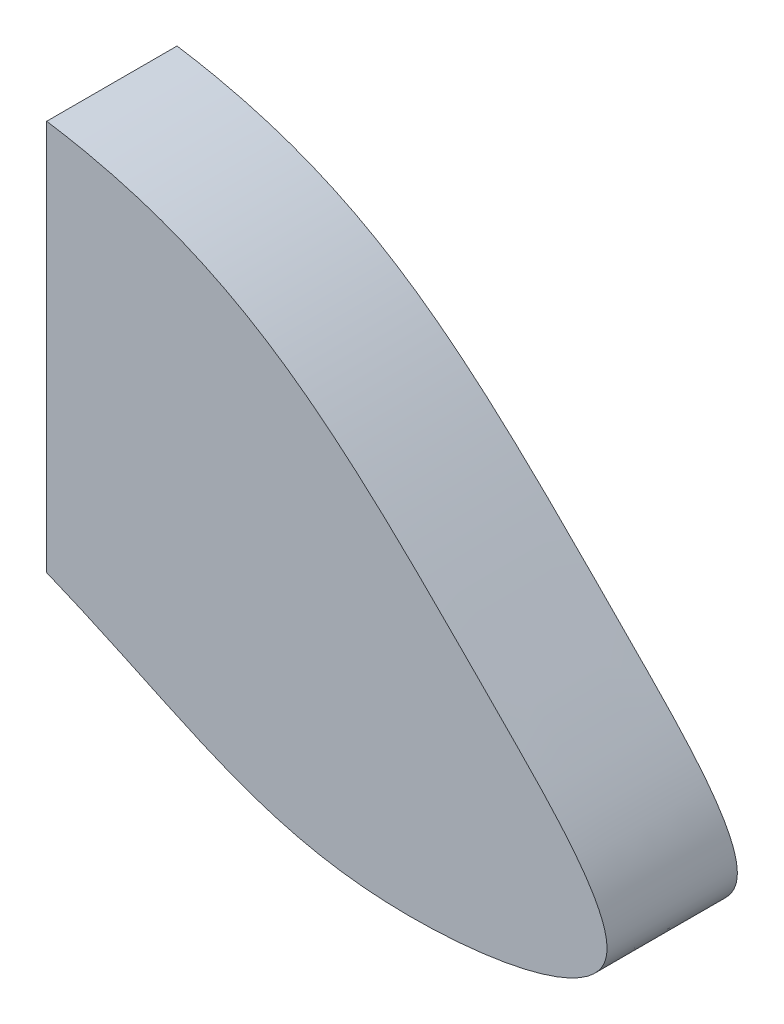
ISO-10303-21;
HEADER;
FILE_DESCRIPTION(('STEP AP214'),'2;1');
FILE_NAME('part.step','',(''),(''),'','','');
FILE_SCHEMA(('AUTOMOTIVE_DESIGN { 1 0 10303 214 1 1 1 1 }'));
ENDSEC;
DATA;
#1=APPLICATION_CONTEXT('core data for automotive mechanical design processes');
#2=APPLICATION_PROTOCOL_DEFINITION('international standard','automotive_design',2000,#1);
#3=PRODUCT_CONTEXT('',#1,'mechanical');
#4=PRODUCT('Part','Part','',(#3));
#5=PRODUCT_RELATED_PRODUCT_CATEGORY('part','',(#4));
#6=PRODUCT_DEFINITION_FORMATION('','',#4);
#7=PRODUCT_DEFINITION_CONTEXT('part definition',#1,'design');
#8=PRODUCT_DEFINITION('design','',#6,#7);
#9=PRODUCT_DEFINITION_SHAPE('','',#8);
#10=(LENGTH_UNIT() NAMED_UNIT(*) SI_UNIT(.MILLI.,.METRE.));
#11=(NAMED_UNIT(*) PLANE_ANGLE_UNIT() SI_UNIT($,.RADIAN.));
#12=(NAMED_UNIT(*) SI_UNIT($,.STERADIAN.) SOLID_ANGLE_UNIT());
#13=UNCERTAINTY_MEASURE_WITH_UNIT(LENGTH_MEASURE(1.E-05),#10,'distance_accuracy_value','');
#14=(GEOMETRIC_REPRESENTATION_CONTEXT(3) GLOBAL_UNCERTAINTY_ASSIGNED_CONTEXT((#13)) GLOBAL_UNIT_ASSIGNED_CONTEXT((#10,
#11,#12)) REPRESENTATION_CONTEXT('',''));
#15=CARTESIAN_POINT('',(0.,0.,0.));
#16=DIRECTION('',(0.,0.,1.));
#17=DIRECTION('',(1.,0.,0.));
#18=AXIS2_PLACEMENT_3D('',#15,#16,#17);
#19=CARTESIAN_POINT('',(0.,0.,6.));
#20=CARTESIAN_POINT('',(6.32106803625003,-2.5668388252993,6.));
#21=CARTESIAN_POINT('',(11.5436831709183,-6.78046893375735,6.));
#22=CARTESIAN_POINT('',(29.4153300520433,-3.90531042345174,6.));
#23=CARTESIAN_POINT('',(15.1380019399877,10.4447731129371,6.));
#24=CARTESIAN_POINT('',(9.40222095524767,16.5391903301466,6.));
#25=CARTESIAN_POINT('',(0.,18.,6.));
#26=B_SPLINE_CURVE_WITH_KNOTS('',3,(#19,#20,#21,#22,#23,#24,#25),.UNSPECIFIED.,.F.,.F.,(4,1,1,1,
4),(0.,0.287409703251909,0.44402408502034,0.584927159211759,1.),.UNSPECIFIED.);
#27=DIRECTION('',(0.,0.,-1.));
#28=VECTOR('',#27,1.);
#29=SURFACE_OF_LINEAR_EXTRUSION('',#26,#28);
#30=CARTESIAN_POINT('',(0.,0.,0.));
#31=CARTESIAN_POINT('',(6.32106803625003,-2.5668388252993,0.));
#32=CARTESIAN_POINT('',(11.5436831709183,-6.78046893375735,0.));
#33=CARTESIAN_POINT('',(29.4153300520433,-3.90531042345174,0.));
#34=CARTESIAN_POINT('',(15.1380019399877,10.4447731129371,0.));
#35=CARTESIAN_POINT('',(9.40222095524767,16.5391903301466,0.));
#36=CARTESIAN_POINT('',(0.,18.,0.));
#37=B_SPLINE_CURVE_WITH_KNOTS('',3,(#30,#31,#32,#33,#34,#35,#36),.UNSPECIFIED.,.F.,.F.,(4,1,1,1,
4),(0.,0.287409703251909,0.44402408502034,0.584927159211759,1.),.UNSPECIFIED.);
#38=CARTESIAN_POINT('',(0.,0.,0.));
#39=VERTEX_POINT('',#38);
#40=CARTESIAN_POINT('',(0.,18.,0.));
#41=VERTEX_POINT('',#40);
#42=EDGE_CURVE('E73',#39,#41,#37,.T.);
#43=ORIENTED_EDGE('',*,*,#42,.T.);
#44=DIRECTION('',(0.,0.,-1.));
#45=VECTOR('',#44,1.);
#46=CARTESIAN_POINT('',(0.,18.,6.));
#47=LINE('',#46,#45);
#48=CARTESIAN_POINT('',(0.,18.,6.));
#49=VERTEX_POINT('',#48);
#50=EDGE_CURVE('E11',#49,#41,#47,.T.);
#51=ORIENTED_EDGE('',*,*,#50,.F.);
#52=CARTESIAN_POINT('',(0.,0.,6.));
#53=VERTEX_POINT('',#52);
#54=EDGE_CURVE('E72',#53,#49,#26,.T.);
#55=ORIENTED_EDGE('',*,*,#54,.F.);
#56=DIRECTION('',(0.,0.,-1.));
#57=VECTOR('',#56,1.);
#58=CARTESIAN_POINT('',(0.,0.,6.));
#59=LINE('',#58,#57);
#60=EDGE_CURVE('E50',#53,#39,#59,.T.);
#61=ORIENTED_EDGE('',*,*,#60,.T.);
#62=EDGE_LOOP('',(#43,#51,#55,#61));
#63=FACE_BOUND('',#62,.T.);
#64=ADVANCED_FACE('F41',(#63),#29,.F.);
#65=CARTESIAN_POINT('',(0.,0.,6.));
#66=DIRECTION('',(1.,0.,0.));
#67=DIRECTION('',(0.,0.,-1.));
#68=AXIS2_PLACEMENT_3D('',#65,#66,#67);
#69=PLANE('',#68);
#70=DIRECTION('',(0.,-1.,0.));
#71=VECTOR('',#70,1.);
#72=CARTESIAN_POINT('',(0.,0.,0.));
#73=LINE('',#72,#71);
#74=EDGE_CURVE('E65',#41,#39,#73,.T.);
#75=ORIENTED_EDGE('',*,*,#74,.T.);
#76=ORIENTED_EDGE('',*,*,#60,.F.);
#77=DIRECTION('',(0.,-1.,0.));
#78=VECTOR('',#77,1.);
#79=CARTESIAN_POINT('',(0.,0.,6.));
#80=LINE('',#79,#78);
#81=EDGE_CURVE('E57',#49,#53,#80,.T.);
#82=ORIENTED_EDGE('',*,*,#81,.F.);
#83=ORIENTED_EDGE('',*,*,#50,.T.);
#84=EDGE_LOOP('',(#75,#76,#82,#83));
#85=FACE_BOUND('',#84,.T.);
#86=ADVANCED_FACE('F68',(#85),#69,.F.);
#87=CARTESIAN_POINT('',(25.0185235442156,-0.00531719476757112,6.));
#88=DIRECTION('',(0.,0.,1.));
#89=DIRECTION('',(1.,0.,0.));
#90=AXIS2_PLACEMENT_3D('',#87,#88,#89);
#91=PLANE('',#90);
#92=ORIENTED_EDGE('',*,*,#54,.T.);
#93=ORIENTED_EDGE('',*,*,#81,.T.);
#94=EDGE_LOOP('',(#92,#93));
#95=FACE_BOUND('',#94,.T.);
#96=ADVANCED_FACE('F90',(#95),#91,.T.);
#97=CARTESIAN_POINT('',(25.0185235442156,-0.00531719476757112,0.));
#98=DIRECTION('',(0.,0.,1.));
#99=DIRECTION('',(1.,0.,0.));
#100=AXIS2_PLACEMENT_3D('',#97,#98,#99);
#101=PLANE('',#100);
#102=ORIENTED_EDGE('',*,*,#42,.F.);
#103=ORIENTED_EDGE('',*,*,#74,.F.);
#104=EDGE_LOOP('',(#102,#103));
#105=FACE_BOUND('',#104,.T.);
#106=ADVANCED_FACE('F76',(#105),#101,.F.);
#107=CLOSED_SHELL('',(#64,#86,#96,#106));
#108=MANIFOLD_SOLID_BREP('B2',#107);
#109=ADVANCED_BREP_SHAPE_REPRESENTATION('',(#18,#108),#14);
#110=SHAPE_DEFINITION_REPRESENTATION(#9,#109);
ENDSEC;
END-ISO-10303-21;
